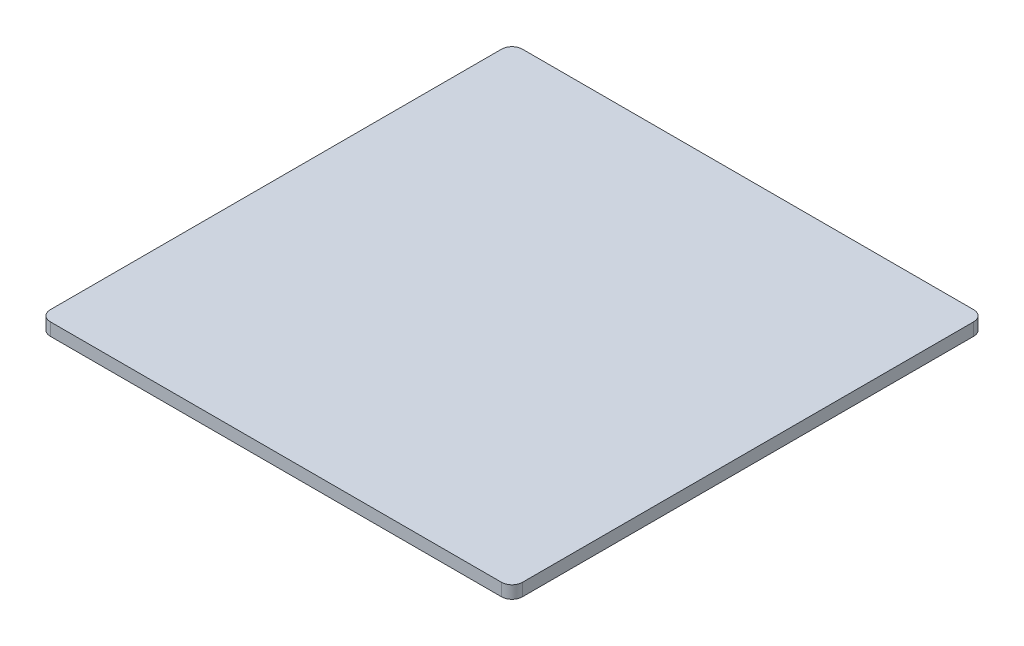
from build123d import *

# Parameters (mm, degrees)
SKETCH1_W           = 450
SKETCH1_H           = 450
BOSS_EXTRUDE1_DEPTH = 12
FILLET1_R           = 10


with BuildPart() as part:
    # Sketch1 → Boss-Extrude1 (new body)
    with BuildSketch(Plane(origin=(0, 0, 0), x_dir=(1, 0, 0), z_dir=(0, 1, 0))):
        Rectangle(SKETCH1_W, SKETCH1_H)
    extrude(amount=-BOSS_EXTRUDE1_DEPTH)

    # Fillet1
    fillet1_edges = [part.edges().sort_by_distance(p)[0] for p in [
        (225, -6, 225),
        (-225, -6, 225),
        (-225, -6, -225),
        (225, -6, -225),
    ]]
    fillet(fillet1_edges, radius=FILLET1_R)


solid = part.part
